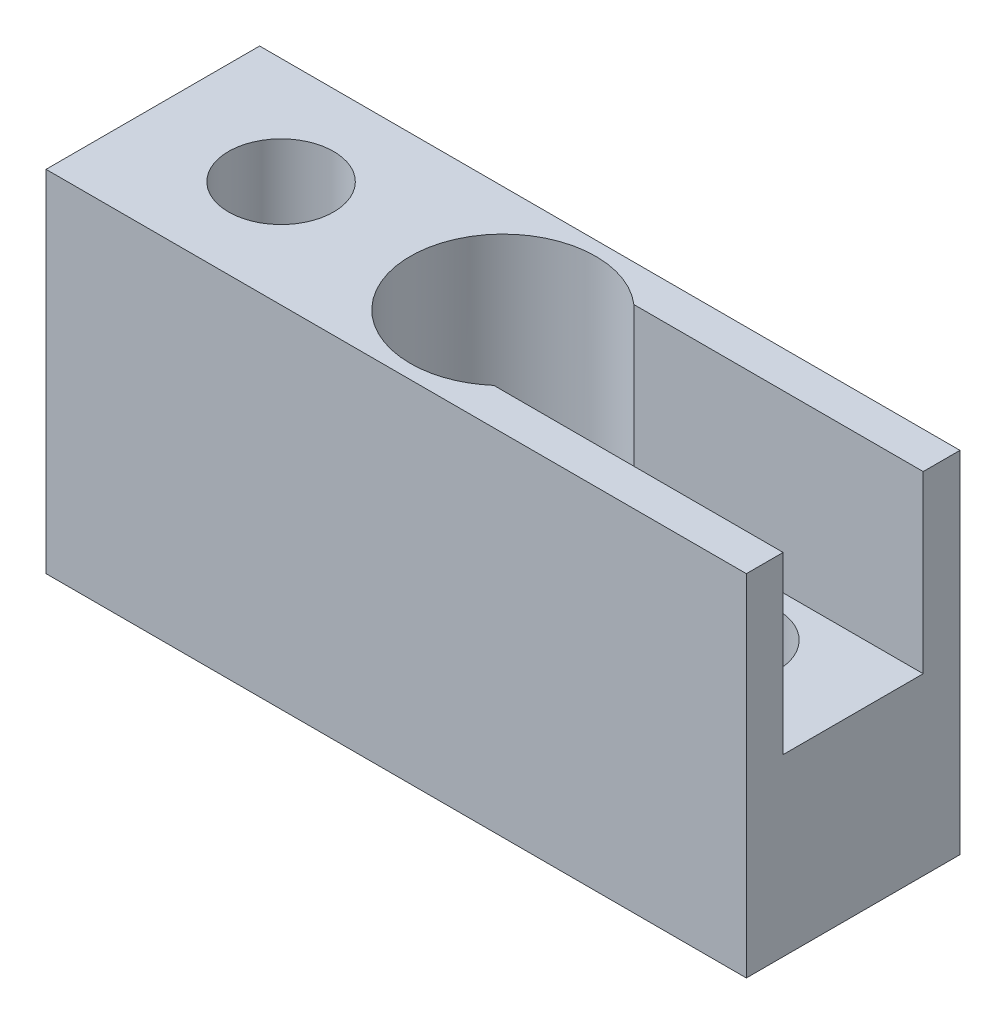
ISO-10303-21;
HEADER;
FILE_DESCRIPTION(('STEP AP214'),'2;1');
FILE_NAME('part.step','',(''),(''),'','','');
FILE_SCHEMA(('AUTOMOTIVE_DESIGN { 1 0 10303 214 1 1 1 1 }'));
ENDSEC;
DATA;
#1=APPLICATION_CONTEXT('core data for automotive mechanical design processes');
#2=APPLICATION_PROTOCOL_DEFINITION('international standard','automotive_design',2000,#1);
#3=PRODUCT_CONTEXT('',#1,'mechanical');
#4=PRODUCT('Part','Part','',(#3));
#5=PRODUCT_RELATED_PRODUCT_CATEGORY('part','',(#4));
#6=PRODUCT_DEFINITION_FORMATION('','',#4);
#7=PRODUCT_DEFINITION_CONTEXT('part definition',#1,'design');
#8=PRODUCT_DEFINITION('design','',#6,#7);
#9=PRODUCT_DEFINITION_SHAPE('','',#8);
#10=(LENGTH_UNIT() NAMED_UNIT(*) SI_UNIT(.MILLI.,.METRE.));
#11=(NAMED_UNIT(*) PLANE_ANGLE_UNIT() SI_UNIT($,.RADIAN.));
#12=(NAMED_UNIT(*) SI_UNIT($,.STERADIAN.) SOLID_ANGLE_UNIT());
#13=UNCERTAINTY_MEASURE_WITH_UNIT(LENGTH_MEASURE(1.E-05),#10,'distance_accuracy_value','');
#14=(GEOMETRIC_REPRESENTATION_CONTEXT(3) GLOBAL_UNCERTAINTY_ASSIGNED_CONTEXT((#13)) GLOBAL_UNIT_ASSIGNED_CONTEXT((#10,
#11,#12)) REPRESENTATION_CONTEXT('',''));
#15=CARTESIAN_POINT('',(0.,0.,0.));
#16=DIRECTION('',(0.,0.,1.));
#17=DIRECTION('',(1.,0.,0.));
#18=AXIS2_PLACEMENT_3D('',#15,#16,#17);
#19=CARTESIAN_POINT('',(-7.325,21.,6.1));
#20=DIRECTION('',(0.,1.,0.));
#21=DIRECTION('',(0.,0.,1.));
#22=AXIS2_PLACEMENT_3D('',#19,#20,#21);
#23=CYLINDRICAL_SURFACE('',#22,3.);
#24=CARTESIAN_POINT('',(-7.325,4.,6.1));
#25=DIRECTION('',(0.,1.,0.));
#26=DIRECTION('',(0.,0.,1.));
#27=AXIS2_PLACEMENT_3D('',#24,#25,#26);
#28=CIRCLE('',#27,3.);
#29=CARTESIAN_POINT('',(-7.325,4.,9.1));
#30=VERTEX_POINT('',#29);
#31=EDGE_CURVE('E505',#30,#30,#28,.T.);
#32=ORIENTED_EDGE('',*,*,#31,.F.);
#33=EDGE_LOOP('',(#32));
#34=FACE_BOUND('',#33,.T.);
#35=CARTESIAN_POINT('',(-7.325,11.,6.1));
#36=DIRECTION('',(0.,1.,0.));
#37=DIRECTION('',(0.,0.,1.));
#38=AXIS2_PLACEMENT_3D('',#35,#36,#37);
#39=CIRCLE('',#38,3.);
#40=CARTESIAN_POINT('',(-7.325,11.,9.1));
#41=VERTEX_POINT('',#40);
#42=EDGE_CURVE('E506',#41,#41,#39,.F.);
#43=ORIENTED_EDGE('',*,*,#42,.F.);
#44=EDGE_LOOP('',(#43));
#45=FACE_BOUND('',#44,.T.);
#46=ADVANCED_FACE('F352',(#34,#45),#23,.F.);
#47=CARTESIAN_POINT('',(-20.,1.,6.1));
#48=DIRECTION('',(0.,-1.,0.));
#49=DIRECTION('',(0.,0.,-1.));
#50=AXIS2_PLACEMENT_3D('',#47,#48,#49);
#51=CYLINDRICAL_SURFACE('',#50,5.);
#52=CARTESIAN_POINT('',(-20.,1.,6.1));
#53=DIRECTION('',(0.,1.,0.));
#54=DIRECTION('',(0.,0.,1.));
#55=AXIS2_PLACEMENT_3D('',#52,#53,#54);
#56=CIRCLE('',#55,5.);
#57=CARTESIAN_POINT('',(-20.,1.,11.1));
#58=VERTEX_POINT('',#57);
#59=EDGE_CURVE('E493',#58,#58,#56,.T.);
#60=ORIENTED_EDGE('',*,*,#59,.F.);
#61=EDGE_LOOP('',(#60));
#62=FACE_BOUND('',#61,.T.);
#63=CARTESIAN_POINT('',(-20.,0.,6.1));
#64=DIRECTION('',(0.,1.,0.));
#65=DIRECTION('',(0.,0.,1.));
#66=AXIS2_PLACEMENT_3D('',#63,#64,#65);
#67=CIRCLE('',#66,5.);
#68=CARTESIAN_POINT('',(-20.,0.,11.1));
#69=VERTEX_POINT('',#68);
#70=EDGE_CURVE('E490',#69,#69,#67,.T.);
#71=ORIENTED_EDGE('',*,*,#70,.T.);
#72=EDGE_LOOP('',(#71));
#73=FACE_BOUND('',#72,.T.);
#74=ADVANCED_FACE('F354',(#62,#73),#51,.T.);
#75=CARTESIAN_POINT('',(-20.,0.,6.1));
#76=DIRECTION('',(0.,1.,0.));
#77=DIRECTION('',(0.,0.,1.));
#78=AXIS2_PLACEMENT_3D('',#75,#76,#77);
#79=PLANE('',#78);
#80=CARTESIAN_POINT('',(-20.,0.,6.1));
#81=DIRECTION('',(0.,-1.,0.));
#82=DIRECTION('',(0.,0.,-1.));
#83=AXIS2_PLACEMENT_3D('',#80,#81,#82);
#84=CIRCLE('',#83,2.35);
#85=CARTESIAN_POINT('',(-20.,0.,3.75));
#86=VERTEX_POINT('',#85);
#87=EDGE_CURVE('E469',#86,#86,#84,.T.);
#88=ORIENTED_EDGE('',*,*,#87,.F.);
#89=EDGE_LOOP('',(#88));
#90=FACE_BOUND('',#89,.T.);
#91=ORIENTED_EDGE('',*,*,#70,.F.);
#92=EDGE_LOOP('',(#91));
#93=FACE_BOUND('',#92,.T.);
#94=ADVANCED_FACE('F551',(#90,#93),#79,.F.);
#95=CARTESIAN_POINT('',(0.,1.,12.2));
#96=DIRECTION('',(0.,-1.,0.));
#97=DIRECTION('',(0.,0.,-1.));
#98=AXIS2_PLACEMENT_3D('',#95,#96,#97);
#99=PLANE('',#98);
#100=CARTESIAN_POINT('',(-7.325,1.,6.1));
#101=DIRECTION('',(0.,-1.,0.));
#102=DIRECTION('',(0.,0.,-1.));
#103=AXIS2_PLACEMENT_3D('',#100,#101,#102);
#104=CIRCLE('',#103,1.65);
#105=CARTESIAN_POINT('',(-7.325,1.,4.45));
#106=VERTEX_POINT('',#105);
#107=EDGE_CURVE('E501',#106,#106,#104,.T.);
#108=ORIENTED_EDGE('',*,*,#107,.F.);
#109=EDGE_LOOP('',(#108));
#110=FACE_BOUND('',#109,.T.);
#111=CARTESIAN_POINT('',(-32.675,1.,6.1));
#112=DIRECTION('',(0.,-1.,0.));
#113=DIRECTION('',(0.,0.,-1.));
#114=AXIS2_PLACEMENT_3D('',#111,#112,#113);
#115=CIRCLE('',#114,1.65);
#116=CARTESIAN_POINT('',(-32.675,1.,4.45));
#117=VERTEX_POINT('',#116);
#118=EDGE_CURVE('E496',#117,#117,#115,.T.);
#119=ORIENTED_EDGE('',*,*,#118,.F.);
#120=EDGE_LOOP('',(#119));
#121=FACE_BOUND('',#120,.T.);
#122=DIRECTION('',(0.,0.,-1.));
#123=VECTOR('',#122,1.);
#124=CARTESIAN_POINT('',(0.,1.,0.));
#125=LINE('',#124,#123);
#126=CARTESIAN_POINT('',(0.,1.,12.2));
#127=VERTEX_POINT('',#126);
#128=CARTESIAN_POINT('',(0.,1.,0.));
#129=VERTEX_POINT('',#128);
#130=EDGE_CURVE('E472',#127,#129,#125,.T.);
#131=ORIENTED_EDGE('',*,*,#130,.F.);
#132=DIRECTION('',(1.,0.,0.));
#133=VECTOR('',#132,1.);
#134=CARTESIAN_POINT('',(0.,1.,12.2));
#135=LINE('',#134,#133);
#136=CARTESIAN_POINT('',(-40.,1.,12.2));
#137=VERTEX_POINT('',#136);
#138=EDGE_CURVE('E375',#137,#127,#135,.T.);
#139=ORIENTED_EDGE('',*,*,#138,.F.);
#140=DIRECTION('',(0.,0.,1.));
#141=VECTOR('',#140,1.);
#142=CARTESIAN_POINT('',(-40.,1.,0.));
#143=LINE('',#142,#141);
#144=CARTESIAN_POINT('',(-40.,1.,0.));
#145=VERTEX_POINT('',#144);
#146=EDGE_CURVE('E477',#145,#137,#143,.T.);
#147=ORIENTED_EDGE('',*,*,#146,.F.);
#148=DIRECTION('',(-1.,0.,0.));
#149=VECTOR('',#148,1.);
#150=CARTESIAN_POINT('',(0.,1.,0.));
#151=LINE('',#150,#149);
#152=EDGE_CURVE('E475',#129,#145,#151,.T.);
#153=ORIENTED_EDGE('',*,*,#152,.F.);
#154=EDGE_LOOP('',(#131,#139,#147,#153));
#155=FACE_BOUND('',#154,.T.);
#156=ORIENTED_EDGE('',*,*,#59,.T.);
#157=EDGE_LOOP('',(#156));
#158=FACE_BOUND('',#157,.T.);
#159=ADVANCED_FACE('F548',(#110,#121,#155,#158),#99,.T.);
#160=CARTESIAN_POINT('',(0.,3.4,0.));
#161=DIRECTION('',(-1.,0.,0.));
#162=DIRECTION('',(0.,0.,1.));
#163=AXIS2_PLACEMENT_3D('',#160,#161,#162);
#164=PLANE('',#163);
#165=DIRECTION('',(0.,0.,-1.));
#166=VECTOR('',#165,1.);
#167=CARTESIAN_POINT('',(0.,21.,0.));
#168=LINE('',#167,#166);
#169=CARTESIAN_POINT('',(0.,21.,2.1));
#170=VERTEX_POINT('',#169);
#171=CARTESIAN_POINT('',(0.,21.,0.));
#172=VERTEX_POINT('',#171);
#173=EDGE_CURVE('E446',#170,#172,#168,.T.);
#174=ORIENTED_EDGE('',*,*,#173,.F.);
#175=DIRECTION('',(0.,1.,0.));
#176=VECTOR('',#175,1.);
#177=CARTESIAN_POINT('',(0.,11.,2.1));
#178=LINE('',#177,#176);
#179=CARTESIAN_POINT('',(0.,11.,2.1));
#180=VERTEX_POINT('',#179);
#181=EDGE_CURVE('E438',#180,#170,#178,.T.);
#182=ORIENTED_EDGE('',*,*,#181,.F.);
#183=DIRECTION('',(0.,0.,-1.));
#184=VECTOR('',#183,1.);
#185=CARTESIAN_POINT('',(0.,11.,2.1));
#186=LINE('',#185,#184);
#187=CARTESIAN_POINT('',(0.,11.,10.1));
#188=VERTEX_POINT('',#187);
#189=EDGE_CURVE('E437',#188,#180,#186,.T.);
#190=ORIENTED_EDGE('',*,*,#189,.F.);
#191=DIRECTION('',(0.,1.,0.));
#192=VECTOR('',#191,1.);
#193=CARTESIAN_POINT('',(0.,11.,10.1));
#194=LINE('',#193,#192);
#195=CARTESIAN_POINT('',(0.,21.,10.1));
#196=VERTEX_POINT('',#195);
#197=EDGE_CURVE('E422',#188,#196,#194,.T.);
#198=ORIENTED_EDGE('',*,*,#197,.T.);
#199=CARTESIAN_POINT('',(0.,21.,12.2));
#200=VERTEX_POINT('',#199);
#201=EDGE_CURVE('E435',#200,#196,#168,.T.);
#202=ORIENTED_EDGE('',*,*,#201,.F.);
#203=DIRECTION('',(0.,-1.,0.));
#204=VECTOR('',#203,1.);
#205=CARTESIAN_POINT('',(0.,3.4,12.2));
#206=LINE('',#205,#204);
#207=EDGE_CURVE('E480',#200,#127,#206,.T.);
#208=ORIENTED_EDGE('',*,*,#207,.T.);
#209=ORIENTED_EDGE('',*,*,#130,.T.);
#210=DIRECTION('',(0.,-1.,0.));
#211=VECTOR('',#210,1.);
#212=CARTESIAN_POINT('',(0.,3.4,0.));
#213=LINE('',#212,#211);
#214=EDGE_CURVE('E487',#172,#129,#213,.T.);
#215=ORIENTED_EDGE('',*,*,#214,.F.);
#216=EDGE_LOOP('',(#174,#182,#190,#198,#202,#208,#209,#215));
#217=FACE_BOUND('',#216,.T.);
#218=ADVANCED_FACE('F434',(#217),#164,.F.);
#219=CARTESIAN_POINT('',(0.,3.4,0.));
#220=DIRECTION('',(0.,0.,1.));
#221=DIRECTION('',(1.,0.,0.));
#222=AXIS2_PLACEMENT_3D('',#219,#220,#221);
#223=PLANE('',#222);
#224=ORIENTED_EDGE('',*,*,#152,.T.);
#225=DIRECTION('',(0.,-1.,0.));
#226=VECTOR('',#225,1.);
#227=CARTESIAN_POINT('',(-40.,3.4,0.));
#228=LINE('',#227,#226);
#229=CARTESIAN_POINT('',(-40.,21.,0.));
#230=VERTEX_POINT('',#229);
#231=EDGE_CURVE('E484',#230,#145,#228,.T.);
#232=ORIENTED_EDGE('',*,*,#231,.F.);
#233=DIRECTION('',(-1.,0.,0.));
#234=VECTOR('',#233,1.);
#235=CARTESIAN_POINT('',(0.,21.,0.));
#236=LINE('',#235,#234);
#237=EDGE_CURVE('E445',#172,#230,#236,.T.);
#238=ORIENTED_EDGE('',*,*,#237,.F.);
#239=ORIENTED_EDGE('',*,*,#214,.T.);
#240=EDGE_LOOP('',(#224,#232,#238,#239));
#241=FACE_BOUND('',#240,.T.);
#242=ADVANCED_FACE('F541',(#241),#223,.F.);
#243=CARTESIAN_POINT('',(-40.,3.4,0.));
#244=DIRECTION('',(1.,0.,0.));
#245=DIRECTION('',(0.,0.,-1.));
#246=AXIS2_PLACEMENT_3D('',#243,#244,#245);
#247=PLANE('',#246);
#248=ORIENTED_EDGE('',*,*,#146,.T.);
#249=DIRECTION('',(0.,-1.,0.));
#250=VECTOR('',#249,1.);
#251=CARTESIAN_POINT('',(-40.,3.4,12.2));
#252=LINE('',#251,#250);
#253=CARTESIAN_POINT('',(-40.,21.,12.2));
#254=VERTEX_POINT('',#253);
#255=EDGE_CURVE('E482',#254,#137,#252,.T.);
#256=ORIENTED_EDGE('',*,*,#255,.F.);
#257=DIRECTION('',(0.,0.,1.));
#258=VECTOR('',#257,1.);
#259=CARTESIAN_POINT('',(-40.,21.,0.));
#260=LINE('',#259,#258);
#261=EDGE_CURVE('E449',#230,#254,#260,.T.);
#262=ORIENTED_EDGE('',*,*,#261,.F.);
#263=ORIENTED_EDGE('',*,*,#231,.T.);
#264=EDGE_LOOP('',(#248,#256,#262,#263));
#265=FACE_BOUND('',#264,.T.);
#266=ADVANCED_FACE('F544',(#265),#247,.F.);
#267=CARTESIAN_POINT('',(0.,3.4,12.2));
#268=DIRECTION('',(0.,0.,-1.));
#269=DIRECTION('',(-1.,0.,0.));
#270=AXIS2_PLACEMENT_3D('',#267,#268,#269);
#271=PLANE('',#270);
#272=ORIENTED_EDGE('',*,*,#138,.T.);
#273=ORIENTED_EDGE('',*,*,#207,.F.);
#274=DIRECTION('',(1.,0.,0.));
#275=VECTOR('',#274,1.);
#276=CARTESIAN_POINT('',(0.,21.,12.2));
#277=LINE('',#276,#275);
#278=EDGE_CURVE('E444',#254,#200,#277,.T.);
#279=ORIENTED_EDGE('',*,*,#278,.F.);
#280=ORIENTED_EDGE('',*,*,#255,.T.);
#281=EDGE_LOOP('',(#272,#273,#279,#280));
#282=FACE_BOUND('',#281,.T.);
#283=ADVANCED_FACE('F546',(#282),#271,.F.);
#284=CARTESIAN_POINT('',(-20.,3.4,6.1));
#285=DIRECTION('',(0.,-1.,0.));
#286=DIRECTION('',(0.,0.,-1.));
#287=AXIS2_PLACEMENT_3D('',#284,#285,#286);
#288=CYLINDRICAL_SURFACE('',#287,2.35);
#289=CARTESIAN_POINT('',(-20.,3.4,6.1));
#290=DIRECTION('',(0.,1.,0.));
#291=DIRECTION('',(0.,0.,1.));
#292=AXIS2_PLACEMENT_3D('',#289,#290,#291);
#293=CIRCLE('',#292,2.35);
#294=CARTESIAN_POINT('',(-20.,3.4,8.45));
#295=VERTEX_POINT('',#294);
#296=EDGE_CURVE('E466',#295,#295,#293,.F.);
#297=ORIENTED_EDGE('',*,*,#296,.F.);
#298=EDGE_LOOP('',(#297));
#299=FACE_BOUND('',#298,.T.);
#300=ORIENTED_EDGE('',*,*,#87,.T.);
#301=EDGE_LOOP('',(#300));
#302=FACE_BOUND('',#301,.T.);
#303=ADVANCED_FACE('F614',(#299,#302),#288,.F.);
#304=CARTESIAN_POINT('',(-20.,3.4,6.1));
#305=DIRECTION('',(0.,1.,0.));
#306=DIRECTION('',(0.,0.,1.));
#307=AXIS2_PLACEMENT_3D('',#304,#305,#306);
#308=PLANE('',#307);
#309=CARTESIAN_POINT('',(-20.,3.4,6.1));
#310=DIRECTION('',(0.,1.,0.));
#311=DIRECTION('',(0.,0.,1.));
#312=AXIS2_PLACEMENT_3D('',#309,#310,#311);
#313=CIRCLE('',#312,3.5);
#314=CARTESIAN_POINT('',(-20.,3.4,9.6));
#315=VERTEX_POINT('',#314);
#316=EDGE_CURVE('E463',#315,#315,#313,.T.);
#317=ORIENTED_EDGE('',*,*,#316,.T.);
#318=EDGE_LOOP('',(#317));
#319=FACE_BOUND('',#318,.T.);
#320=ORIENTED_EDGE('',*,*,#296,.T.);
#321=EDGE_LOOP('',(#320));
#322=FACE_BOUND('',#321,.T.);
#323=ADVANCED_FACE('F611',(#319,#322),#308,.T.);
#324=CARTESIAN_POINT('',(-20.,3.4,6.1));
#325=DIRECTION('',(0.,1.,0.));
#326=DIRECTION('',(0.,0.,1.));
#327=AXIS2_PLACEMENT_3D('',#324,#325,#326);
#328=CYLINDRICAL_SURFACE('',#327,3.5);
#329=ORIENTED_EDGE('',*,*,#316,.F.);
#330=EDGE_LOOP('',(#329));
#331=FACE_BOUND('',#330,.T.);
#332=CARTESIAN_POINT('',(-20.,5.,6.1));
#333=DIRECTION('',(0.,-1.,0.));
#334=DIRECTION('',(0.,0.,-1.));
#335=AXIS2_PLACEMENT_3D('',#332,#333,#334);
#336=CIRCLE('',#335,3.5);
#337=CARTESIAN_POINT('',(-20.,5.,2.6));
#338=VERTEX_POINT('',#337);
#339=EDGE_CURVE('E460',#338,#338,#336,.F.);
#340=ORIENTED_EDGE('',*,*,#339,.T.);
#341=EDGE_LOOP('',(#340));
#342=FACE_BOUND('',#341,.T.);
#343=ADVANCED_FACE('F609',(#331,#342),#328,.F.);
#344=CARTESIAN_POINT('',(0.,5.,12.2));
#345=DIRECTION('',(0.,-1.,0.));
#346=DIRECTION('',(0.,0.,-1.));
#347=AXIS2_PLACEMENT_3D('',#344,#345,#346);
#348=PLANE('',#347);
#349=CARTESIAN_POINT('',(-20.,5.,6.1));
#350=DIRECTION('',(0.,1.,0.));
#351=DIRECTION('',(0.,0.,1.));
#352=AXIS2_PLACEMENT_3D('',#349,#350,#351);
#353=CIRCLE('',#352,2.35);
#354=CARTESIAN_POINT('',(-20.,5.,8.45));
#355=VERTEX_POINT('',#354);
#356=EDGE_CURVE('E457',#355,#355,#353,.T.);
#357=ORIENTED_EDGE('',*,*,#356,.T.);
#358=EDGE_LOOP('',(#357));
#359=FACE_BOUND('',#358,.T.);
#360=ORIENTED_EDGE('',*,*,#339,.F.);
#361=EDGE_LOOP('',(#360));
#362=FACE_BOUND('',#361,.T.);
#363=ADVANCED_FACE('F605',(#359,#362),#348,.T.);
#364=CARTESIAN_POINT('',(-20.,5.,6.1));
#365=DIRECTION('',(0.,1.,0.));
#366=DIRECTION('',(0.,0.,1.));
#367=AXIS2_PLACEMENT_3D('',#364,#365,#366);
#368=CYLINDRICAL_SURFACE('',#367,2.35);
#369=ORIENTED_EDGE('',*,*,#356,.F.);
#370=EDGE_LOOP('',(#369));
#371=FACE_BOUND('',#370,.T.);
#372=CARTESIAN_POINT('',(-20.,7.4,6.1));
#373=DIRECTION('',(0.,1.,0.));
#374=DIRECTION('',(0.,0.,1.));
#375=AXIS2_PLACEMENT_3D('',#372,#373,#374);
#376=CIRCLE('',#375,2.35);
#377=CARTESIAN_POINT('',(-20.,7.4,8.45));
#378=VERTEX_POINT('',#377);
#379=EDGE_CURVE('E451',#378,#378,#376,.F.);
#380=ORIENTED_EDGE('',*,*,#379,.F.);
#381=EDGE_LOOP('',(#380));
#382=FACE_BOUND('',#381,.T.);
#383=ADVANCED_FACE('F601',(#371,#382),#368,.F.);
#384=CARTESIAN_POINT('',(0.,21.,12.2));
#385=DIRECTION('',(0.,-1.,0.));
#386=DIRECTION('',(0.,0.,-1.));
#387=AXIS2_PLACEMENT_3D('',#384,#385,#386);
#388=PLANE('',#387);
#389=CARTESIAN_POINT('',(-32.675,21.,6.1));
#390=DIRECTION('',(0.,1.,0.));
#391=DIRECTION('',(0.,0.,1.));
#392=AXIS2_PLACEMENT_3D('',#389,#390,#391);
#393=CIRCLE('',#392,3.);
#394=CARTESIAN_POINT('',(-32.675,21.,9.1));
#395=VERTEX_POINT('',#394);
#396=EDGE_CURVE('E500',#395,#395,#393,.T.);
#397=ORIENTED_EDGE('',*,*,#396,.F.);
#398=EDGE_LOOP('',(#397));
#399=FACE_BOUND('',#398,.T.);
#400=CARTESIAN_POINT('',(-20.,21.,6.1));
#401=DIRECTION('',(0.,1.,0.));
#402=DIRECTION('',(0.,0.,1.));
#403=AXIS2_PLACEMENT_3D('',#400,#401,#402);
#404=CIRCLE('',#403,5.3);
#405=CARTESIAN_POINT('',(-16.5229322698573,21.,2.1));
#406=VERTEX_POINT('',#405);
#407=CARTESIAN_POINT('',(-16.5229322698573,21.,10.1));
#408=VERTEX_POINT('',#407);
#409=EDGE_CURVE('E499',#406,#408,#404,.T.);
#410=ORIENTED_EDGE('',*,*,#409,.F.);
#411=DIRECTION('',(-1.,0.,0.));
#412=VECTOR('',#411,1.);
#413=CARTESIAN_POINT('',(-20.,21.,2.1));
#414=LINE('',#413,#412);
#415=EDGE_CURVE('E429',#170,#406,#414,.T.);
#416=ORIENTED_EDGE('',*,*,#415,.F.);
#417=ORIENTED_EDGE('',*,*,#173,.T.);
#418=ORIENTED_EDGE('',*,*,#237,.T.);
#419=ORIENTED_EDGE('',*,*,#261,.T.);
#420=ORIENTED_EDGE('',*,*,#278,.T.);
#421=ORIENTED_EDGE('',*,*,#201,.T.);
#422=DIRECTION('',(1.,0.,0.));
#423=VECTOR('',#422,1.);
#424=CARTESIAN_POINT('',(-20.,21.,10.1));
#425=LINE('',#424,#423);
#426=EDGE_CURVE('E418',#408,#196,#425,.T.);
#427=ORIENTED_EDGE('',*,*,#426,.F.);
#428=EDGE_LOOP('',(#410,#416,#417,#418,#419,#420,#421,#427));
#429=FACE_BOUND('',#428,.T.);
#430=ADVANCED_FACE('F441',(#399,#429),#388,.F.);
#431=CARTESIAN_POINT('',(-20.,7.4,6.1));
#432=DIRECTION('',(0.,1.,0.));
#433=DIRECTION('',(0.,0.,1.));
#434=AXIS2_PLACEMENT_3D('',#431,#432,#433);
#435=PLANE('',#434);
#436=CARTESIAN_POINT('',(-20.,7.4,6.1));
#437=DIRECTION('',(0.,1.,0.));
#438=DIRECTION('',(0.,0.,1.));
#439=AXIS2_PLACEMENT_3D('',#436,#437,#438);
#440=CIRCLE('',#439,5.3);
#441=CARTESIAN_POINT('',(-20.,7.4,11.4));
#442=VERTEX_POINT('',#441);
#443=EDGE_CURVE('E513',#442,#442,#440,.T.);
#444=ORIENTED_EDGE('',*,*,#443,.T.);
#445=EDGE_LOOP('',(#444));
#446=FACE_BOUND('',#445,.T.);
#447=ORIENTED_EDGE('',*,*,#379,.T.);
#448=EDGE_LOOP('',(#447));
#449=FACE_BOUND('',#448,.T.);
#450=ADVANCED_FACE('F592',(#446,#449),#435,.T.);
#451=CARTESIAN_POINT('',(-20.,7.4,6.1));
#452=DIRECTION('',(0.,1.,0.));
#453=DIRECTION('',(0.,0.,1.));
#454=AXIS2_PLACEMENT_3D('',#451,#452,#453);
#455=CYLINDRICAL_SURFACE('',#454,5.3);
#456=ORIENTED_EDGE('',*,*,#443,.F.);
#457=EDGE_LOOP('',(#456));
#458=FACE_BOUND('',#457,.T.);
#459=CARTESIAN_POINT('',(-20.,11.,6.1));
#460=DIRECTION('',(0.,1.,0.));
#461=DIRECTION('',(0.,0.,1.));
#462=AXIS2_PLACEMENT_3D('',#459,#460,#461);
#463=CIRCLE('',#462,5.3);
#464=CARTESIAN_POINT('',(-16.5229322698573,11.,2.1));
#465=VERTEX_POINT('',#464);
#466=CARTESIAN_POINT('',(-16.5229322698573,11.,10.1));
#467=VERTEX_POINT('',#466);
#468=EDGE_CURVE('E508',#465,#467,#463,.F.);
#469=ORIENTED_EDGE('',*,*,#468,.F.);
#470=DIRECTION('',(0.,1.,0.));
#471=VECTOR('',#470,1.);
#472=CARTESIAN_POINT('',(-16.5229322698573,7.4,2.1));
#473=LINE('',#472,#471);
#474=EDGE_CURVE('E11',#465,#406,#473,.T.);
#475=ORIENTED_EDGE('',*,*,#474,.T.);
#476=ORIENTED_EDGE('',*,*,#409,.T.);
#477=DIRECTION('',(0.,1.,0.));
#478=VECTOR('',#477,1.);
#479=CARTESIAN_POINT('',(-16.5229322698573,7.4,10.1));
#480=LINE('',#479,#478);
#481=EDGE_CURVE('E360',#408,#467,#480,.F.);
#482=ORIENTED_EDGE('',*,*,#481,.T.);
#483=EDGE_LOOP('',(#469,#475,#476,#482));
#484=FACE_BOUND('',#483,.T.);
#485=ADVANCED_FACE('F511',(#458,#484),#455,.F.);
#486=CARTESIAN_POINT('',(-32.675,21.,6.1));
#487=DIRECTION('',(0.,1.,0.));
#488=DIRECTION('',(0.,0.,1.));
#489=AXIS2_PLACEMENT_3D('',#486,#487,#488);
#490=CYLINDRICAL_SURFACE('',#489,3.);
#491=CARTESIAN_POINT('',(-32.675,4.,6.1));
#492=DIRECTION('',(0.,1.,0.));
#493=DIRECTION('',(0.,0.,1.));
#494=AXIS2_PLACEMENT_3D('',#491,#492,#493);
#495=CIRCLE('',#494,3.);
#496=CARTESIAN_POINT('',(-32.675,4.,9.1));
#497=VERTEX_POINT('',#496);
#498=EDGE_CURVE('E519',#497,#497,#495,.T.);
#499=ORIENTED_EDGE('',*,*,#498,.F.);
#500=EDGE_LOOP('',(#499));
#501=FACE_BOUND('',#500,.T.);
#502=ORIENTED_EDGE('',*,*,#396,.T.);
#503=EDGE_LOOP('',(#502));
#504=FACE_BOUND('',#503,.T.);
#505=ADVANCED_FACE('F587',(#501,#504),#490,.F.);
#506=CARTESIAN_POINT('',(-31.025,4.,6.1));
#507=DIRECTION('',(0.,-1.,0.));
#508=DIRECTION('',(0.,0.,-1.));
#509=AXIS2_PLACEMENT_3D('',#506,#507,#508);
#510=PLANE('',#509);
#511=CARTESIAN_POINT('',(-32.675,4.,6.1));
#512=DIRECTION('',(0.,1.,0.));
#513=DIRECTION('',(0.,0.,1.));
#514=AXIS2_PLACEMENT_3D('',#511,#512,#513);
#515=CIRCLE('',#514,1.65);
#516=CARTESIAN_POINT('',(-32.675,4.,7.74999999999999));
#517=VERTEX_POINT('',#516);
#518=EDGE_CURVE('E504',#517,#517,#515,.T.);
#519=ORIENTED_EDGE('',*,*,#518,.F.);
#520=EDGE_LOOP('',(#519));
#521=FACE_BOUND('',#520,.T.);
#522=ORIENTED_EDGE('',*,*,#498,.T.);
#523=EDGE_LOOP('',(#522));
#524=FACE_BOUND('',#523,.T.);
#525=ADVANCED_FACE('F583',(#521,#524),#510,.F.);
#526=CARTESIAN_POINT('',(-32.675,21.,6.1));
#527=DIRECTION('',(0.,1.,0.));
#528=DIRECTION('',(0.,0.,1.));
#529=AXIS2_PLACEMENT_3D('',#526,#527,#528);
#530=CYLINDRICAL_SURFACE('',#529,1.65);
#531=ORIENTED_EDGE('',*,*,#118,.T.);
#532=EDGE_LOOP('',(#531));
#533=FACE_BOUND('',#532,.T.);
#534=ORIENTED_EDGE('',*,*,#518,.T.);
#535=EDGE_LOOP('',(#534));
#536=FACE_BOUND('',#535,.T.);
#537=ADVANCED_FACE('F580',(#533,#536),#530,.F.);
#538=CARTESIAN_POINT('',(-5.675,4.,6.1));
#539=DIRECTION('',(0.,-1.,0.));
#540=DIRECTION('',(0.,0.,-1.));
#541=AXIS2_PLACEMENT_3D('',#538,#539,#540);
#542=PLANE('',#541);
#543=CARTESIAN_POINT('',(-7.325,4.,6.1));
#544=DIRECTION('',(0.,1.,0.));
#545=DIRECTION('',(0.,0.,1.));
#546=AXIS2_PLACEMENT_3D('',#543,#544,#545);
#547=CIRCLE('',#546,1.65);
#548=CARTESIAN_POINT('',(-7.325,4.,7.75));
#549=VERTEX_POINT('',#548);
#550=EDGE_CURVE('E526',#549,#549,#547,.T.);
#551=ORIENTED_EDGE('',*,*,#550,.F.);
#552=EDGE_LOOP('',(#551));
#553=FACE_BOUND('',#552,.T.);
#554=ORIENTED_EDGE('',*,*,#31,.T.);
#555=EDGE_LOOP('',(#554));
#556=FACE_BOUND('',#555,.T.);
#557=ADVANCED_FACE('F578',(#553,#556),#542,.F.);
#558=CARTESIAN_POINT('',(-7.325,21.,6.1));
#559=DIRECTION('',(0.,1.,0.));
#560=DIRECTION('',(0.,0.,1.));
#561=AXIS2_PLACEMENT_3D('',#558,#559,#560);
#562=CYLINDRICAL_SURFACE('',#561,1.65);
#563=ORIENTED_EDGE('',*,*,#107,.T.);
#564=EDGE_LOOP('',(#563));
#565=FACE_BOUND('',#564,.T.);
#566=ORIENTED_EDGE('',*,*,#550,.T.);
#567=EDGE_LOOP('',(#566));
#568=FACE_BOUND('',#567,.T.);
#569=ADVANCED_FACE('F648',(#565,#568),#562,.F.);
#570=CARTESIAN_POINT('',(-20.,11.,2.1));
#571=DIRECTION('',(0.,0.,-1.));
#572=DIRECTION('',(-1.,0.,0.));
#573=AXIS2_PLACEMENT_3D('',#570,#571,#572);
#574=PLANE('',#573);
#575=DIRECTION('',(-1.,0.,0.));
#576=VECTOR('',#575,1.);
#577=CARTESIAN_POINT('',(-20.,11.,2.1));
#578=LINE('',#577,#576);
#579=EDGE_CURVE('E367',#180,#465,#578,.T.);
#580=ORIENTED_EDGE('',*,*,#579,.F.);
#581=ORIENTED_EDGE('',*,*,#181,.T.);
#582=ORIENTED_EDGE('',*,*,#415,.T.);
#583=ORIENTED_EDGE('',*,*,#474,.F.);
#584=EDGE_LOOP('',(#580,#581,#582,#583));
#585=FACE_BOUND('',#584,.T.);
#586=ADVANCED_FACE('F536',(#585),#574,.F.);
#587=CARTESIAN_POINT('',(-20.,11.,10.1));
#588=DIRECTION('',(0.,0.,1.));
#589=DIRECTION('',(1.,0.,0.));
#590=AXIS2_PLACEMENT_3D('',#587,#588,#589);
#591=PLANE('',#590);
#592=ORIENTED_EDGE('',*,*,#426,.T.);
#593=ORIENTED_EDGE('',*,*,#197,.F.);
#594=DIRECTION('',(1.,0.,0.));
#595=VECTOR('',#594,1.);
#596=CARTESIAN_POINT('',(-20.,11.,10.1));
#597=LINE('',#596,#595);
#598=EDGE_CURVE('E533',#467,#188,#597,.T.);
#599=ORIENTED_EDGE('',*,*,#598,.F.);
#600=ORIENTED_EDGE('',*,*,#481,.F.);
#601=EDGE_LOOP('',(#592,#593,#599,#600));
#602=FACE_BOUND('',#601,.T.);
#603=ADVANCED_FACE('F420',(#602),#591,.F.);
#604=CARTESIAN_POINT('',(-20.,11.,2.1));
#605=DIRECTION('',(0.,1.,0.));
#606=DIRECTION('',(0.,0.,1.));
#607=AXIS2_PLACEMENT_3D('',#604,#605,#606);
#608=PLANE('',#607);
#609=ORIENTED_EDGE('',*,*,#42,.T.);
#610=EDGE_LOOP('',(#609));
#611=FACE_BOUND('',#610,.T.);
#612=ORIENTED_EDGE('',*,*,#468,.T.);
#613=ORIENTED_EDGE('',*,*,#598,.T.);
#614=ORIENTED_EDGE('',*,*,#189,.T.);
#615=ORIENTED_EDGE('',*,*,#579,.T.);
#616=EDGE_LOOP('',(#612,#613,#614,#615));
#617=FACE_BOUND('',#616,.T.);
#618=ADVANCED_FACE('F655',(#611,#617),#608,.T.);
#619=CLOSED_SHELL('',(#46,#74,#94,#159,#218,#242,#266,#283,#303,#323,#343,#363,#383,#430,#450,
#485,#505,#525,#537,#557,#569,#586,#603,#618));
#620=MANIFOLD_SOLID_BREP('B2',#619);
#621=ADVANCED_BREP_SHAPE_REPRESENTATION('',(#18,#620),#14);
#622=SHAPE_DEFINITION_REPRESENTATION(#9,#621);
ENDSEC;
END-ISO-10303-21;
